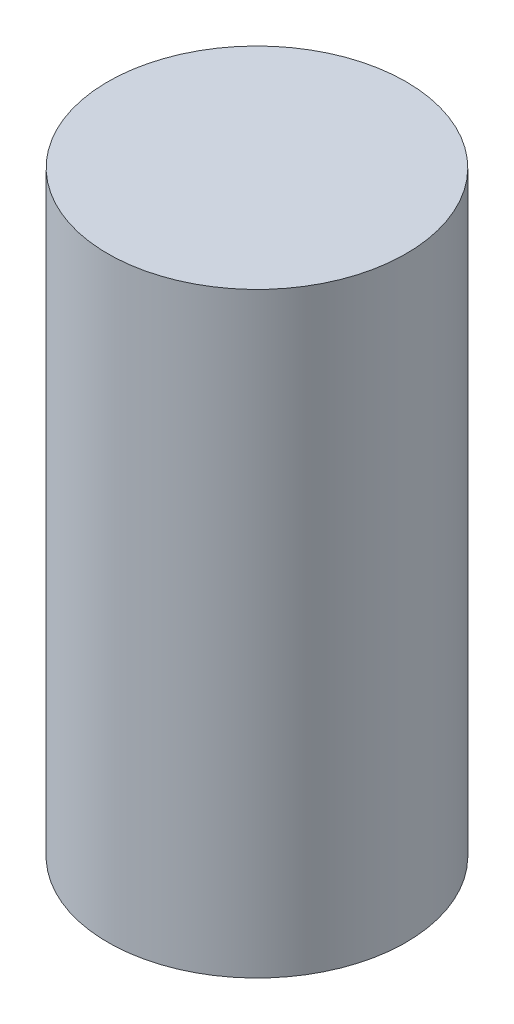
from build123d import *

# Parameters (mm, degrees)
ESQUISSE1_W = 1.5
ESQUISSE1_H = 6


with BuildPart() as part:
    # Esquisse1 → R_volution1 (revolve)
    with BuildSketch(Plane.XY, mode=Mode.PRIVATE) as r_volution1_sk:
        with Locations((0.75, 3)):
            Rectangle(ESQUISSE1_W, ESQUISSE1_H)
    revolve(r_volution1_sk.sketch.rotate(Axis((0, 0, 0), (0, 1, 0)), 90), axis=Axis((0, 0, 0), (0, 1, 0)))


solid = part.part
